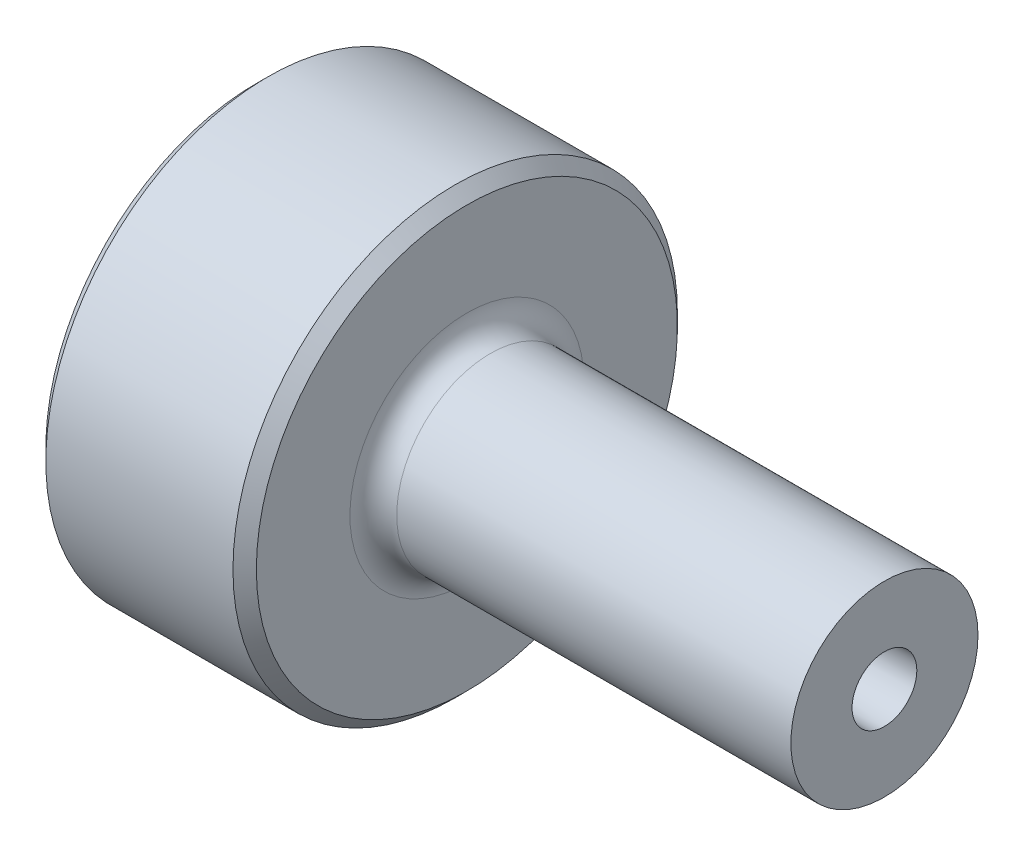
ISO-10303-21;
HEADER;
FILE_DESCRIPTION(('STEP AP214'),'2;1');
FILE_NAME('part.step','',(''),(''),'','','');
FILE_SCHEMA(('AUTOMOTIVE_DESIGN { 1 0 10303 214 1 1 1 1 }'));
ENDSEC;
DATA;
#1=APPLICATION_CONTEXT('core data for automotive mechanical design processes');
#2=APPLICATION_PROTOCOL_DEFINITION('international standard','automotive_design',2000,#1);
#3=PRODUCT_CONTEXT('',#1,'mechanical');
#4=PRODUCT('Part','Part','',(#3));
#5=PRODUCT_RELATED_PRODUCT_CATEGORY('part','',(#4));
#6=PRODUCT_DEFINITION_FORMATION('','',#4);
#7=PRODUCT_DEFINITION_CONTEXT('part definition',#1,'design');
#8=PRODUCT_DEFINITION('design','',#6,#7);
#9=PRODUCT_DEFINITION_SHAPE('','',#8);
#10=(LENGTH_UNIT() NAMED_UNIT(*) SI_UNIT(.MILLI.,.METRE.));
#11=(NAMED_UNIT(*) PLANE_ANGLE_UNIT() SI_UNIT($,.RADIAN.));
#12=(NAMED_UNIT(*) SI_UNIT($,.STERADIAN.) SOLID_ANGLE_UNIT());
#13=UNCERTAINTY_MEASURE_WITH_UNIT(LENGTH_MEASURE(1.E-05),#10,'distance_accuracy_value','');
#14=(GEOMETRIC_REPRESENTATION_CONTEXT(3) GLOBAL_UNCERTAINTY_ASSIGNED_CONTEXT((#13)) GLOBAL_UNIT_ASSIGNED_CONTEXT((#10,
#11,#12)) REPRESENTATION_CONTEXT('',''));
#15=CARTESIAN_POINT('',(0.,0.,0.));
#16=DIRECTION('',(0.,0.,1.));
#17=DIRECTION('',(1.,0.,0.));
#18=AXIS2_PLACEMENT_3D('',#15,#16,#17);
#19=CARTESIAN_POINT('',(36.85,0.,0.));
#20=DIRECTION('',(1.,0.,0.));
#21=DIRECTION('',(0.,0.,-1.));
#22=AXIS2_PLACEMENT_3D('',#19,#20,#21);
#23=CYLINDRICAL_SURFACE('',#22,8.);
#24=CARTESIAN_POINT('',(20.,0.,0.));
#25=DIRECTION('',(1.,0.,0.));
#26=DIRECTION('',(0.,0.,-1.));
#27=AXIS2_PLACEMENT_3D('',#24,#25,#26);
#28=CIRCLE('',#27,7.99999999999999);
#29=CARTESIAN_POINT('',(20.,0.,-7.99999999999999));
#30=VERTEX_POINT('',#29);
#31=EDGE_CURVE('E86',#30,#30,#28,.T.);
#32=ORIENTED_EDGE('',*,*,#31,.T.);
#33=EDGE_LOOP('',(#32));
#34=FACE_BOUND('',#33,.T.);
#35=CARTESIAN_POINT('',(53.7,0.,0.));
#36=DIRECTION('',(1.,0.,0.));
#37=DIRECTION('',(0.,0.,-1.));
#38=AXIS2_PLACEMENT_3D('',#35,#36,#37);
#39=CIRCLE('',#38,8.);
#40=CARTESIAN_POINT('',(53.7,0.,-8.));
#41=VERTEX_POINT('',#40);
#42=EDGE_CURVE('E18',#41,#41,#39,.T.);
#43=ORIENTED_EDGE('',*,*,#42,.F.);
#44=EDGE_LOOP('',(#43));
#45=FACE_BOUND('',#44,.T.);
#46=ADVANCED_FACE('F15',(#34,#45),#23,.T.);
#47=CARTESIAN_POINT('',(53.7,5.38463636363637,0.));
#48=DIRECTION('',(1.,0.,0.));
#49=DIRECTION('',(0.,0.,-1.));
#50=AXIS2_PLACEMENT_3D('',#47,#48,#49);
#51=PLANE('',#50);
#52=CARTESIAN_POINT('',(53.6999999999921,0.,0.));
#53=DIRECTION('',(1.,0.,0.));
#54=DIRECTION('',(0.,0.,-1.));
#55=AXIS2_PLACEMENT_3D('',#52,#53,#54);
#56=CIRCLE('',#55,2.76927272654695);
#57=CARTESIAN_POINT('',(53.6999999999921,0.,-2.76927272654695));
#58=VERTEX_POINT('',#57);
#59=EDGE_CURVE('E84',#58,#58,#56,.F.);
#60=ORIENTED_EDGE('',*,*,#59,.T.);
#61=EDGE_LOOP('',(#60));
#62=FACE_BOUND('',#61,.T.);
#63=ORIENTED_EDGE('',*,*,#42,.T.);
#64=EDGE_LOOP('',(#63));
#65=FACE_BOUND('',#64,.T.);
#66=ADVANCED_FACE('F64',(#62,#65),#51,.T.);
#67=CARTESIAN_POINT('',(20.,0.,0.));
#68=DIRECTION('',(1.,0.,0.));
#69=DIRECTION('',(0.,0.,-1.));
#70=AXIS2_PLACEMENT_3D('',#67,#68,#69);
#71=TOROIDAL_SURFACE('',#70,10.,2.);
#72=CARTESIAN_POINT('',(18.,0.,0.));
#73=DIRECTION('',(1.,0.,0.));
#74=DIRECTION('',(0.,1.,0.));
#75=AXIS2_PLACEMENT_3D('',#72,#73,#74);
#76=CIRCLE('',#75,10.);
#77=CARTESIAN_POINT('',(18.,10.,0.));
#78=VERTEX_POINT('',#77);
#79=EDGE_CURVE('E38',#78,#78,#76,.F.);
#80=ORIENTED_EDGE('',*,*,#79,.F.);
#81=EDGE_LOOP('',(#80));
#82=FACE_BOUND('',#81,.T.);
#83=ORIENTED_EDGE('',*,*,#31,.F.);
#84=EDGE_LOOP('',(#83));
#85=FACE_BOUND('',#84,.T.);
#86=ADVANCED_FACE('F60',(#82,#85),#71,.F.);
#87=CARTESIAN_POINT('',(53.6999999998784,0.,0.));
#88=DIRECTION('',(1.,0.,0.));
#89=DIRECTION('',(0.,0.,-1.));
#90=AXIS2_PLACEMENT_3D('',#87,#88,#89);
#91=CONICAL_SURFACE('',#90,2.76927272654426,0.0236319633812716);
#92=ORIENTED_EDGE('',*,*,#59,.F.);
#93=EDGE_LOOP('',(#92));
#94=FACE_BOUND('',#93,.T.);
#95=CARTESIAN_POINT('',(0.,0.,0.));
#96=DIRECTION('',(1.,0.,0.));
#97=DIRECTION('',(0.,0.,-1.));
#98=AXIS2_PLACEMENT_3D('',#95,#96,#97);
#99=CIRCLE('',#98,1.50000000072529);
#100=CARTESIAN_POINT('',(0.,0.,-1.50000000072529));
#101=VERTEX_POINT('',#100);
#102=EDGE_CURVE('E82',#101,#101,#99,.T.);
#103=ORIENTED_EDGE('',*,*,#102,.F.);
#104=EDGE_LOOP('',(#103));
#105=FACE_BOUND('',#104,.T.);
#106=ADVANCED_FACE('F56',(#94,#105),#91,.F.);
#107=CARTESIAN_POINT('',(18.,14.,0.));
#108=DIRECTION('',(1.,0.,0.));
#109=DIRECTION('',(0.,0.,-1.));
#110=AXIS2_PLACEMENT_3D('',#107,#108,#109);
#111=PLANE('',#110);
#112=ORIENTED_EDGE('',*,*,#79,.T.);
#113=EDGE_LOOP('',(#112));
#114=FACE_BOUND('',#113,.T.);
#115=CARTESIAN_POINT('',(18.0000000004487,0.,0.));
#116=DIRECTION('',(-1.,0.,0.));
#117=DIRECTION('',(0.,0.,1.));
#118=AXIS2_PLACEMENT_3D('',#115,#116,#117);
#119=CIRCLE('',#118,18.0000000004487);
#120=CARTESIAN_POINT('',(18.0000000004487,0.,18.0000000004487));
#121=VERTEX_POINT('',#120);
#122=EDGE_CURVE('E79',#121,#121,#119,.T.);
#123=ORIENTED_EDGE('',*,*,#122,.F.);
#124=EDGE_LOOP('',(#123));
#125=FACE_BOUND('',#124,.T.);
#126=ADVANCED_FACE('F45',(#114,#125),#111,.T.);
#127=CARTESIAN_POINT('',(0.,9.75,0.));
#128=DIRECTION('',(-1.,0.,0.));
#129=DIRECTION('',(0.,0.,1.));
#130=AXIS2_PLACEMENT_3D('',#127,#128,#129);
#131=PLANE('',#130);
#132=ORIENTED_EDGE('',*,*,#102,.T.);
#133=EDGE_LOOP('',(#132));
#134=FACE_BOUND('',#133,.T.);
#135=CARTESIAN_POINT('',(-4.48724607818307E-10,0.,0.));
#136=DIRECTION('',(1.,0.,0.));
#137=DIRECTION('',(0.,0.,-1.));
#138=AXIS2_PLACEMENT_3D('',#135,#136,#137);
#139=CIRCLE('',#138,18.0000000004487);
#140=CARTESIAN_POINT('',(-4.48724607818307E-10,0.,-18.0000000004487));
#141=VERTEX_POINT('',#140);
#142=EDGE_CURVE('E27',#141,#141,#139,.T.);
#143=ORIENTED_EDGE('',*,*,#142,.F.);
#144=EDGE_LOOP('',(#143));
#145=FACE_BOUND('',#144,.T.);
#146=ADVANCED_FACE('F55',(#134,#145),#131,.T.);
#147=CARTESIAN_POINT('',(16.9999999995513,0.,0.));
#148=DIRECTION('',(-1.,0.,0.));
#149=DIRECTION('',(0.,0.,1.));
#150=AXIS2_PLACEMENT_3D('',#147,#148,#149);
#151=CONICAL_SURFACE('',#150,18.9999999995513,0.7853981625);
#152=CARTESIAN_POINT('',(17.,0.,0.));
#153=DIRECTION('',(1.,0.,0.));
#154=DIRECTION('',(0.,0.,-1.));
#155=AXIS2_PLACEMENT_3D('',#152,#153,#154);
#156=CIRCLE('',#155,19.);
#157=CARTESIAN_POINT('',(17.,0.,-19.));
#158=VERTEX_POINT('',#157);
#159=EDGE_CURVE('E22',#158,#158,#156,.F.);
#160=ORIENTED_EDGE('',*,*,#159,.F.);
#161=EDGE_LOOP('',(#160));
#162=FACE_BOUND('',#161,.T.);
#163=ORIENTED_EDGE('',*,*,#122,.T.);
#164=EDGE_LOOP('',(#163));
#165=FACE_BOUND('',#164,.T.);
#166=ADVANCED_FACE('F109',(#162,#165),#151,.T.);
#167=CARTESIAN_POINT('',(1.00000000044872,0.,0.));
#168=DIRECTION('',(1.,0.,0.));
#169=DIRECTION('',(0.,0.,-1.));
#170=AXIS2_PLACEMENT_3D('',#167,#168,#169);
#171=CONICAL_SURFACE('',#170,18.9999999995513,0.785398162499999);
#172=ORIENTED_EDGE('',*,*,#142,.T.);
#173=EDGE_LOOP('',(#172));
#174=FACE_BOUND('',#173,.T.);
#175=CARTESIAN_POINT('',(0.999999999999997,0.,0.));
#176=DIRECTION('',(1.,0.,0.));
#177=DIRECTION('',(0.,0.,-1.));
#178=AXIS2_PLACEMENT_3D('',#175,#176,#177);
#179=CIRCLE('',#178,19.);
#180=CARTESIAN_POINT('',(0.999999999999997,0.,-19.));
#181=VERTEX_POINT('',#180);
#182=EDGE_CURVE('E10',#181,#181,#179,.T.);
#183=ORIENTED_EDGE('',*,*,#182,.F.);
#184=EDGE_LOOP('',(#183));
#185=FACE_BOUND('',#184,.T.);
#186=ADVANCED_FACE('F104',(#174,#185),#171,.T.);
#187=CARTESIAN_POINT('',(9.,0.,0.));
#188=DIRECTION('',(1.,0.,0.));
#189=DIRECTION('',(0.,0.,-1.));
#190=AXIS2_PLACEMENT_3D('',#187,#188,#189);
#191=CYLINDRICAL_SURFACE('',#190,19.);
#192=ORIENTED_EDGE('',*,*,#182,.T.);
#193=EDGE_LOOP('',(#192));
#194=FACE_BOUND('',#193,.T.);
#195=ORIENTED_EDGE('',*,*,#159,.T.);
#196=EDGE_LOOP('',(#195));
#197=FACE_BOUND('',#196,.T.);
#198=ADVANCED_FACE('F102',(#194,#197),#191,.T.);
#199=CLOSED_SHELL('',(#46,#66,#86,#106,#126,#146,#166,#186,#198));
#200=MANIFOLD_SOLID_BREP('B1',#199);
#201=ADVANCED_BREP_SHAPE_REPRESENTATION('',(#18,#200),#14);
#202=SHAPE_DEFINITION_REPRESENTATION(#9,#201);
ENDSEC;
END-ISO-10303-21;
